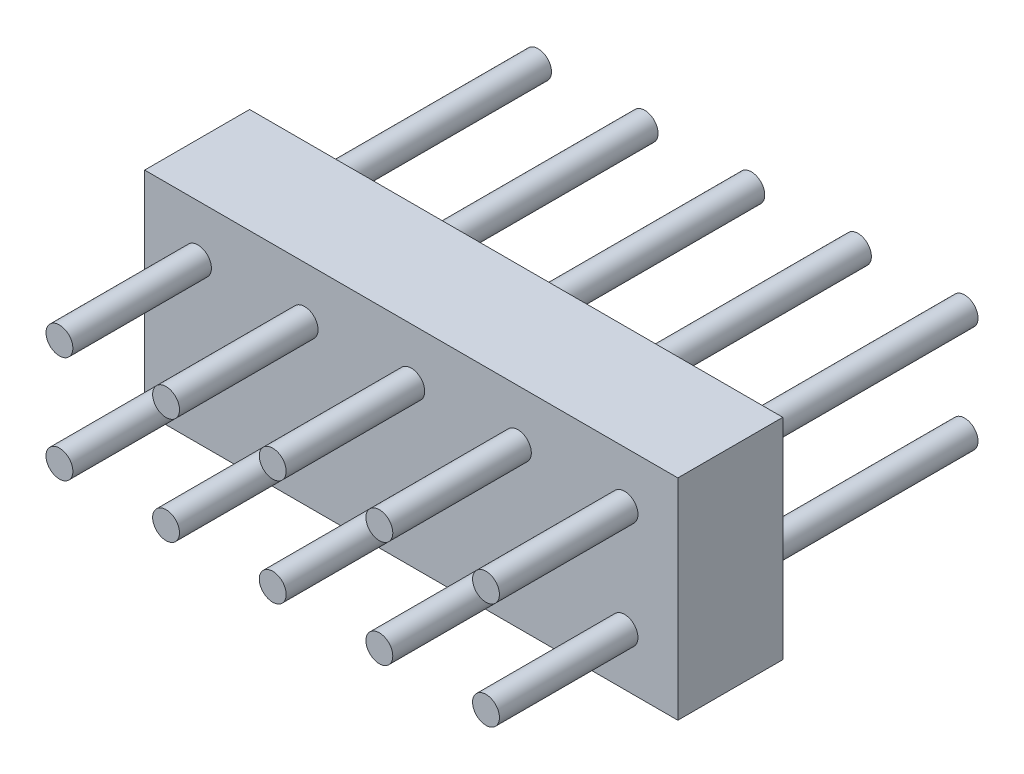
ISO-10303-21;
HEADER;
FILE_DESCRIPTION(('STEP AP214'),'2;1');
FILE_NAME('part.step','',(''),(''),'','','');
FILE_SCHEMA(('AUTOMOTIVE_DESIGN { 1 0 10303 214 1 1 1 1 }'));
ENDSEC;
DATA;
#1=APPLICATION_CONTEXT('core data for automotive mechanical design processes');
#2=APPLICATION_PROTOCOL_DEFINITION('international standard','automotive_design',2000,#1);
#3=PRODUCT_CONTEXT('',#1,'mechanical');
#4=PRODUCT('Part','Part','',(#3));
#5=PRODUCT_RELATED_PRODUCT_CATEGORY('part','',(#4));
#6=PRODUCT_DEFINITION_FORMATION('','',#4);
#7=PRODUCT_DEFINITION_CONTEXT('part definition',#1,'design');
#8=PRODUCT_DEFINITION('design','',#6,#7);
#9=PRODUCT_DEFINITION_SHAPE('','',#8);
#10=(LENGTH_UNIT() NAMED_UNIT(*) SI_UNIT(.MILLI.,.METRE.));
#11=(NAMED_UNIT(*) PLANE_ANGLE_UNIT() SI_UNIT($,.RADIAN.));
#12=(NAMED_UNIT(*) SI_UNIT($,.STERADIAN.) SOLID_ANGLE_UNIT());
#13=UNCERTAINTY_MEASURE_WITH_UNIT(LENGTH_MEASURE(1.E-05),#10,'distance_accuracy_value','');
#14=(GEOMETRIC_REPRESENTATION_CONTEXT(3) GLOBAL_UNCERTAINTY_ASSIGNED_CONTEXT((#13)) GLOBAL_UNIT_ASSIGNED_CONTEXT((#10,
#11,#12)) REPRESENTATION_CONTEXT('',''));
#15=CARTESIAN_POINT('',(0.,0.,0.));
#16=DIRECTION('',(0.,0.,1.));
#17=DIRECTION('',(1.,0.,0.));
#18=AXIS2_PLACEMENT_3D('',#15,#16,#17);
#19=CARTESIAN_POINT('',(0.,0.,2.5));
#20=DIRECTION('',(-1.,0.,0.));
#21=DIRECTION('',(0.,0.,1.));
#22=AXIS2_PLACEMENT_3D('',#19,#20,#21);
#23=PLANE('',#22);
#24=DIRECTION('',(0.,1.,0.));
#25=VECTOR('',#24,1.);
#26=CARTESIAN_POINT('',(0.,0.,0.));
#27=LINE('',#26,#25);
#28=CARTESIAN_POINT('',(0.,0.,0.));
#29=VERTEX_POINT('',#28);
#30=CARTESIAN_POINT('',(0.,5.,0.));
#31=VERTEX_POINT('',#30);
#32=EDGE_CURVE('E104',#29,#31,#27,.T.);
#33=ORIENTED_EDGE('',*,*,#32,.F.);
#34=DIRECTION('',(0.,0.,-1.));
#35=VECTOR('',#34,1.);
#36=CARTESIAN_POINT('',(0.,0.,2.5));
#37=LINE('',#36,#35);
#38=CARTESIAN_POINT('',(0.,0.,2.5));
#39=VERTEX_POINT('',#38);
#40=EDGE_CURVE('E51',#39,#29,#37,.T.);
#41=ORIENTED_EDGE('',*,*,#40,.F.);
#42=DIRECTION('',(0.,1.,0.));
#43=VECTOR('',#42,1.);
#44=CARTESIAN_POINT('',(0.,0.,2.5));
#45=LINE('',#44,#43);
#46=CARTESIAN_POINT('',(0.,5.,2.5));
#47=VERTEX_POINT('',#46);
#48=EDGE_CURVE('E98',#39,#47,#45,.T.);
#49=ORIENTED_EDGE('',*,*,#48,.T.);
#50=DIRECTION('',(0.,0.,-1.));
#51=VECTOR('',#50,1.);
#52=CARTESIAN_POINT('',(0.,5.,2.5));
#53=LINE('',#52,#51);
#54=EDGE_CURVE('E76',#47,#31,#53,.T.);
#55=ORIENTED_EDGE('',*,*,#54,.T.);
#56=EDGE_LOOP('',(#33,#41,#49,#55));
#57=FACE_BOUND('',#56,.T.);
#58=ADVANCED_FACE('F35',(#57),#23,.T.);
#59=CARTESIAN_POINT('',(0.,0.,2.5));
#60=DIRECTION('',(0.,1.,0.));
#61=DIRECTION('',(0.,0.,1.));
#62=AXIS2_PLACEMENT_3D('',#59,#60,#61);
#63=PLANE('',#62);
#64=DIRECTION('',(1.,0.,0.));
#65=VECTOR('',#64,1.);
#66=CARTESIAN_POINT('',(0.,0.,0.));
#67=LINE('',#66,#65);
#68=CARTESIAN_POINT('',(12.7,0.,0.));
#69=VERTEX_POINT('',#68);
#70=EDGE_CURVE('E68',#29,#69,#67,.T.);
#71=ORIENTED_EDGE('',*,*,#70,.T.);
#72=DIRECTION('',(0.,0.,-1.));
#73=VECTOR('',#72,1.);
#74=CARTESIAN_POINT('',(12.7,0.,2.5));
#75=LINE('',#74,#73);
#76=CARTESIAN_POINT('',(12.7,0.,2.5));
#77=VERTEX_POINT('',#76);
#78=EDGE_CURVE('E95',#77,#69,#75,.T.);
#79=ORIENTED_EDGE('',*,*,#78,.F.);
#80=DIRECTION('',(1.,0.,0.));
#81=VECTOR('',#80,1.);
#82=CARTESIAN_POINT('',(0.,0.,2.5));
#83=LINE('',#82,#81);
#84=EDGE_CURVE('E86',#39,#77,#83,.T.);
#85=ORIENTED_EDGE('',*,*,#84,.F.);
#86=ORIENTED_EDGE('',*,*,#40,.T.);
#87=EDGE_LOOP('',(#71,#79,#85,#86));
#88=FACE_BOUND('',#87,.T.);
#89=ADVANCED_FACE('F278',(#88),#63,.F.);
#90=CARTESIAN_POINT('',(12.7,0.,2.5));
#91=DIRECTION('',(-1.,0.,0.));
#92=DIRECTION('',(0.,0.,1.));
#93=AXIS2_PLACEMENT_3D('',#90,#91,#92);
#94=PLANE('',#93);
#95=DIRECTION('',(0.,1.,0.));
#96=VECTOR('',#95,1.);
#97=CARTESIAN_POINT('',(12.7,0.,0.));
#98=LINE('',#97,#96);
#99=CARTESIAN_POINT('',(12.7,5.,0.));
#100=VERTEX_POINT('',#99);
#101=EDGE_CURVE('E93',#69,#100,#98,.T.);
#102=ORIENTED_EDGE('',*,*,#101,.T.);
#103=DIRECTION('',(0.,0.,-1.));
#104=VECTOR('',#103,1.);
#105=CARTESIAN_POINT('',(12.7,5.,2.5));
#106=LINE('',#105,#104);
#107=CARTESIAN_POINT('',(12.7,5.,2.5));
#108=VERTEX_POINT('',#107);
#109=EDGE_CURVE('E90',#108,#100,#106,.T.);
#110=ORIENTED_EDGE('',*,*,#109,.F.);
#111=DIRECTION('',(0.,1.,0.));
#112=VECTOR('',#111,1.);
#113=CARTESIAN_POINT('',(12.7,0.,2.5));
#114=LINE('',#113,#112);
#115=EDGE_CURVE('E81',#77,#108,#114,.T.);
#116=ORIENTED_EDGE('',*,*,#115,.F.);
#117=ORIENTED_EDGE('',*,*,#78,.T.);
#118=EDGE_LOOP('',(#102,#110,#116,#117));
#119=FACE_BOUND('',#118,.T.);
#120=ADVANCED_FACE('F91',(#119),#94,.F.);
#121=CARTESIAN_POINT('',(0.,5.,2.5));
#122=DIRECTION('',(0.,1.,0.));
#123=DIRECTION('',(0.,0.,1.));
#124=AXIS2_PLACEMENT_3D('',#121,#122,#123);
#125=PLANE('',#124);
#126=DIRECTION('',(1.,0.,0.));
#127=VECTOR('',#126,1.);
#128=CARTESIAN_POINT('',(0.,5.,0.));
#129=LINE('',#128,#127);
#130=EDGE_CURVE('E107',#31,#100,#129,.T.);
#131=ORIENTED_EDGE('',*,*,#130,.F.);
#132=ORIENTED_EDGE('',*,*,#54,.F.);
#133=DIRECTION('',(1.,0.,0.));
#134=VECTOR('',#133,1.);
#135=CARTESIAN_POINT('',(0.,5.,2.5));
#136=LINE('',#135,#134);
#137=EDGE_CURVE('E85',#47,#108,#136,.T.);
#138=ORIENTED_EDGE('',*,*,#137,.T.);
#139=ORIENTED_EDGE('',*,*,#109,.T.);
#140=EDGE_LOOP('',(#131,#132,#138,#139));
#141=FACE_BOUND('',#140,.T.);
#142=ADVANCED_FACE('F97',(#141),#125,.T.);
#143=CARTESIAN_POINT('',(0.,0.,2.5));
#144=DIRECTION('',(0.,0.,-1.));
#145=DIRECTION('',(-1.,0.,0.));
#146=AXIS2_PLACEMENT_3D('',#143,#144,#145);
#147=PLANE('',#146);
#148=CARTESIAN_POINT('',(1.27,3.77,2.5));
#149=DIRECTION('',(0.,0.,-1.));
#150=DIRECTION('',(-1.,0.,0.));
#151=AXIS2_PLACEMENT_3D('',#148,#149,#150);
#152=CIRCLE('',#151,0.32);
#153=CARTESIAN_POINT('',(0.949999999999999,3.77,2.5));
#154=VERTEX_POINT('',#153);
#155=EDGE_CURVE('E177',#154,#154,#152,.T.);
#156=ORIENTED_EDGE('',*,*,#155,.T.);
#157=EDGE_LOOP('',(#156));
#158=FACE_BOUND('',#157,.T.);
#159=CARTESIAN_POINT('',(3.81,3.77,2.5));
#160=DIRECTION('',(0.,0.,-1.));
#161=DIRECTION('',(-1.,0.,0.));
#162=AXIS2_PLACEMENT_3D('',#159,#160,#161);
#163=CIRCLE('',#162,0.319999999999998);
#164=CARTESIAN_POINT('',(3.49,3.77,2.5));
#165=VERTEX_POINT('',#164);
#166=EDGE_CURVE('E171',#165,#165,#163,.T.);
#167=ORIENTED_EDGE('',*,*,#166,.T.);
#168=EDGE_LOOP('',(#167));
#169=FACE_BOUND('',#168,.T.);
#170=CARTESIAN_POINT('',(6.35,3.77,2.5));
#171=DIRECTION('',(0.,0.,-1.));
#172=DIRECTION('',(-1.,0.,0.));
#173=AXIS2_PLACEMENT_3D('',#170,#171,#172);
#174=CIRCLE('',#173,0.32);
#175=CARTESIAN_POINT('',(6.03,3.77,2.5));
#176=VERTEX_POINT('',#175);
#177=EDGE_CURVE('E165',#176,#176,#174,.T.);
#178=ORIENTED_EDGE('',*,*,#177,.T.);
#179=EDGE_LOOP('',(#178));
#180=FACE_BOUND('',#179,.T.);
#181=CARTESIAN_POINT('',(8.88999999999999,3.77,2.5));
#182=DIRECTION('',(0.,0.,-1.));
#183=DIRECTION('',(-1.,0.,0.));
#184=AXIS2_PLACEMENT_3D('',#181,#182,#183);
#185=CIRCLE('',#184,0.319999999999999);
#186=CARTESIAN_POINT('',(8.56999999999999,3.77,2.5));
#187=VERTEX_POINT('',#186);
#188=EDGE_CURVE('E161',#187,#187,#185,.T.);
#189=ORIENTED_EDGE('',*,*,#188,.T.);
#190=EDGE_LOOP('',(#189));
#191=FACE_BOUND('',#190,.T.);
#192=CARTESIAN_POINT('',(8.89,1.23,2.5));
#193=DIRECTION('',(0.,0.,-1.));
#194=DIRECTION('',(-1.,0.,0.));
#195=AXIS2_PLACEMENT_3D('',#192,#193,#194);
#196=CIRCLE('',#195,0.319999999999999);
#197=CARTESIAN_POINT('',(8.57,1.23,2.5));
#198=VERTEX_POINT('',#197);
#199=EDGE_CURVE('E11',#198,#198,#196,.F.);
#200=ORIENTED_EDGE('',*,*,#199,.F.);
#201=EDGE_LOOP('',(#200));
#202=FACE_BOUND('',#201,.T.);
#203=CARTESIAN_POINT('',(11.43,1.23,2.5));
#204=DIRECTION('',(0.,0.,-1.));
#205=DIRECTION('',(-1.,0.,0.));
#206=AXIS2_PLACEMENT_3D('',#203,#204,#205);
#207=CIRCLE('',#206,0.319999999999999);
#208=CARTESIAN_POINT('',(11.11,1.23,2.5));
#209=VERTEX_POINT('',#208);
#210=EDGE_CURVE('E43',#209,#209,#207,.F.);
#211=ORIENTED_EDGE('',*,*,#210,.F.);
#212=EDGE_LOOP('',(#211));
#213=FACE_BOUND('',#212,.T.);
#214=CARTESIAN_POINT('',(1.27,1.23,2.5));
#215=DIRECTION('',(0.,0.,-1.));
#216=DIRECTION('',(-1.,0.,0.));
#217=AXIS2_PLACEMENT_3D('',#214,#215,#216);
#218=CIRCLE('',#217,0.32);
#219=CARTESIAN_POINT('',(0.95,1.23,2.5));
#220=VERTEX_POINT('',#219);
#221=EDGE_CURVE('E121',#220,#220,#218,.F.);
#222=ORIENTED_EDGE('',*,*,#221,.F.);
#223=EDGE_LOOP('',(#222));
#224=FACE_BOUND('',#223,.T.);
#225=CARTESIAN_POINT('',(3.81,1.23,2.5));
#226=DIRECTION('',(0.,0.,-1.));
#227=DIRECTION('',(-1.,0.,0.));
#228=AXIS2_PLACEMENT_3D('',#225,#226,#227);
#229=CIRCLE('',#228,0.32);
#230=CARTESIAN_POINT('',(3.49,1.23,2.5));
#231=VERTEX_POINT('',#230);
#232=EDGE_CURVE('E118',#231,#231,#229,.F.);
#233=ORIENTED_EDGE('',*,*,#232,.F.);
#234=EDGE_LOOP('',(#233));
#235=FACE_BOUND('',#234,.T.);
#236=CARTESIAN_POINT('',(6.35,1.23,2.5));
#237=DIRECTION('',(0.,0.,-1.));
#238=DIRECTION('',(-1.,0.,0.));
#239=AXIS2_PLACEMENT_3D('',#236,#237,#238);
#240=CIRCLE('',#239,0.32);
#241=CARTESIAN_POINT('',(6.03,1.23,2.5));
#242=VERTEX_POINT('',#241);
#243=EDGE_CURVE('E113',#242,#242,#240,.F.);
#244=ORIENTED_EDGE('',*,*,#243,.F.);
#245=EDGE_LOOP('',(#244));
#246=FACE_BOUND('',#245,.T.);
#247=CARTESIAN_POINT('',(11.43,3.77,2.5));
#248=DIRECTION('',(0.,0.,-1.));
#249=DIRECTION('',(-1.,0.,0.));
#250=AXIS2_PLACEMENT_3D('',#247,#248,#249);
#251=CIRCLE('',#250,0.319999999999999);
#252=CARTESIAN_POINT('',(11.11,3.77,2.5));
#253=VERTEX_POINT('',#252);
#254=EDGE_CURVE('E141',#253,#253,#251,.T.);
#255=ORIENTED_EDGE('',*,*,#254,.T.);
#256=EDGE_LOOP('',(#255));
#257=FACE_BOUND('',#256,.T.);
#258=ORIENTED_EDGE('',*,*,#48,.F.);
#259=ORIENTED_EDGE('',*,*,#84,.T.);
#260=ORIENTED_EDGE('',*,*,#115,.T.);
#261=ORIENTED_EDGE('',*,*,#137,.F.);
#262=EDGE_LOOP('',(#258,#259,#260,#261));
#263=FACE_BOUND('',#262,.T.);
#264=ADVANCED_FACE('F84',(#158,#169,#180,#191,#202,#213,#224,#235,#246,#257,#263),#147,.F.);
#265=CARTESIAN_POINT('',(0.,0.,0.));
#266=DIRECTION('',(0.,0.,-1.));
#267=DIRECTION('',(-1.,0.,0.));
#268=AXIS2_PLACEMENT_3D('',#265,#266,#267);
#269=PLANE('',#268);
#270=CARTESIAN_POINT('',(1.27,3.77,0.));
#271=DIRECTION('',(0.,0.,-1.));
#272=DIRECTION('',(-1.,0.,0.));
#273=AXIS2_PLACEMENT_3D('',#270,#271,#272);
#274=CIRCLE('',#273,0.32);
#275=CARTESIAN_POINT('',(0.949999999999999,3.77,0.));
#276=VERTEX_POINT('',#275);
#277=EDGE_CURVE('E240',#276,#276,#274,.T.);
#278=ORIENTED_EDGE('',*,*,#277,.F.);
#279=EDGE_LOOP('',(#278));
#280=FACE_BOUND('',#279,.T.);
#281=CARTESIAN_POINT('',(3.81,3.77,0.));
#282=DIRECTION('',(0.,0.,-1.));
#283=DIRECTION('',(-1.,0.,0.));
#284=AXIS2_PLACEMENT_3D('',#281,#282,#283);
#285=CIRCLE('',#284,0.319999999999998);
#286=CARTESIAN_POINT('',(3.49,3.77,0.));
#287=VERTEX_POINT('',#286);
#288=EDGE_CURVE('E234',#287,#287,#285,.T.);
#289=ORIENTED_EDGE('',*,*,#288,.F.);
#290=EDGE_LOOP('',(#289));
#291=FACE_BOUND('',#290,.T.);
#292=CARTESIAN_POINT('',(6.35,3.77,0.));
#293=DIRECTION('',(0.,0.,-1.));
#294=DIRECTION('',(-1.,0.,0.));
#295=AXIS2_PLACEMENT_3D('',#292,#293,#294);
#296=CIRCLE('',#295,0.32);
#297=CARTESIAN_POINT('',(6.03,3.77,0.));
#298=VERTEX_POINT('',#297);
#299=EDGE_CURVE('E228',#298,#298,#296,.T.);
#300=ORIENTED_EDGE('',*,*,#299,.F.);
#301=EDGE_LOOP('',(#300));
#302=FACE_BOUND('',#301,.T.);
#303=CARTESIAN_POINT('',(8.88999999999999,3.77,0.));
#304=DIRECTION('',(0.,0.,-1.));
#305=DIRECTION('',(-1.,0.,0.));
#306=AXIS2_PLACEMENT_3D('',#303,#304,#305);
#307=CIRCLE('',#306,0.319999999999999);
#308=CARTESIAN_POINT('',(8.56999999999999,3.77,0.));
#309=VERTEX_POINT('',#308);
#310=EDGE_CURVE('E222',#309,#309,#307,.T.);
#311=ORIENTED_EDGE('',*,*,#310,.F.);
#312=EDGE_LOOP('',(#311));
#313=FACE_BOUND('',#312,.T.);
#314=CARTESIAN_POINT('',(11.43,1.23,0.));
#315=DIRECTION('',(0.,0.,-1.));
#316=DIRECTION('',(-1.,0.,0.));
#317=AXIS2_PLACEMENT_3D('',#314,#315,#316);
#318=CIRCLE('',#317,0.319999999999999);
#319=CARTESIAN_POINT('',(11.11,1.23,0.));
#320=VERTEX_POINT('',#319);
#321=EDGE_CURVE('E216',#320,#320,#318,.T.);
#322=ORIENTED_EDGE('',*,*,#321,.F.);
#323=EDGE_LOOP('',(#322));
#324=FACE_BOUND('',#323,.T.);
#325=CARTESIAN_POINT('',(8.89,1.23,0.));
#326=DIRECTION('',(0.,0.,-1.));
#327=DIRECTION('',(-1.,0.,0.));
#328=AXIS2_PLACEMENT_3D('',#325,#326,#327);
#329=CIRCLE('',#328,0.319999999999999);
#330=CARTESIAN_POINT('',(8.57,1.23,0.));
#331=VERTEX_POINT('',#330);
#332=EDGE_CURVE('E210',#331,#331,#329,.T.);
#333=ORIENTED_EDGE('',*,*,#332,.F.);
#334=EDGE_LOOP('',(#333));
#335=FACE_BOUND('',#334,.T.);
#336=CARTESIAN_POINT('',(6.35,1.23,0.));
#337=DIRECTION('',(0.,0.,-1.));
#338=DIRECTION('',(-1.,0.,0.));
#339=AXIS2_PLACEMENT_3D('',#336,#337,#338);
#340=CIRCLE('',#339,0.32);
#341=CARTESIAN_POINT('',(6.03,1.23,0.));
#342=VERTEX_POINT('',#341);
#343=EDGE_CURVE('E204',#342,#342,#340,.T.);
#344=ORIENTED_EDGE('',*,*,#343,.F.);
#345=EDGE_LOOP('',(#344));
#346=FACE_BOUND('',#345,.T.);
#347=CARTESIAN_POINT('',(3.81,1.23,0.));
#348=DIRECTION('',(0.,0.,-1.));
#349=DIRECTION('',(-1.,0.,0.));
#350=AXIS2_PLACEMENT_3D('',#347,#348,#349);
#351=CIRCLE('',#350,0.32);
#352=CARTESIAN_POINT('',(3.49,1.23,0.));
#353=VERTEX_POINT('',#352);
#354=EDGE_CURVE('E198',#353,#353,#351,.T.);
#355=ORIENTED_EDGE('',*,*,#354,.F.);
#356=EDGE_LOOP('',(#355));
#357=FACE_BOUND('',#356,.T.);
#358=CARTESIAN_POINT('',(11.43,3.77,0.));
#359=DIRECTION('',(0.,0.,-1.));
#360=DIRECTION('',(-1.,0.,0.));
#361=AXIS2_PLACEMENT_3D('',#358,#359,#360);
#362=CIRCLE('',#361,0.319999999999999);
#363=CARTESIAN_POINT('',(11.11,3.77,0.));
#364=VERTEX_POINT('',#363);
#365=EDGE_CURVE('E192',#364,#364,#362,.T.);
#366=ORIENTED_EDGE('',*,*,#365,.F.);
#367=EDGE_LOOP('',(#366));
#368=FACE_BOUND('',#367,.T.);
#369=CARTESIAN_POINT('',(1.27,1.23,0.));
#370=DIRECTION('',(0.,0.,-1.));
#371=DIRECTION('',(-1.,0.,0.));
#372=AXIS2_PLACEMENT_3D('',#369,#370,#371);
#373=CIRCLE('',#372,0.32);
#374=CARTESIAN_POINT('',(0.95,1.23,0.));
#375=VERTEX_POINT('',#374);
#376=EDGE_CURVE('E186',#375,#375,#373,.T.);
#377=ORIENTED_EDGE('',*,*,#376,.F.);
#378=EDGE_LOOP('',(#377));
#379=FACE_BOUND('',#378,.T.);
#380=ORIENTED_EDGE('',*,*,#32,.T.);
#381=ORIENTED_EDGE('',*,*,#130,.T.);
#382=ORIENTED_EDGE('',*,*,#101,.F.);
#383=ORIENTED_EDGE('',*,*,#70,.F.);
#384=EDGE_LOOP('',(#380,#381,#382,#383));
#385=FACE_BOUND('',#384,.T.);
#386=ADVANCED_FACE('F130',(#280,#291,#302,#313,#324,#335,#346,#357,#368,#379,#385),#269,.T.);
#387=CARTESIAN_POINT('',(11.43,3.77,5.8));
#388=DIRECTION('',(0.,0.,-1.));
#389=DIRECTION('',(-1.,0.,0.));
#390=AXIS2_PLACEMENT_3D('',#387,#388,#389);
#391=CYLINDRICAL_SURFACE('',#390,0.319999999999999);
#392=CARTESIAN_POINT('',(11.43,3.77,5.8));
#393=DIRECTION('',(0.,0.,-1.));
#394=DIRECTION('',(-1.,0.,0.));
#395=AXIS2_PLACEMENT_3D('',#392,#393,#394);
#396=CIRCLE('',#395,0.319999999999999);
#397=CARTESIAN_POINT('',(11.11,3.77,5.8));
#398=VERTEX_POINT('',#397);
#399=EDGE_CURVE('E108',#398,#398,#396,.T.);
#400=ORIENTED_EDGE('',*,*,#399,.T.);
#401=EDGE_LOOP('',(#400));
#402=FACE_BOUND('',#401,.T.);
#403=ORIENTED_EDGE('',*,*,#254,.F.);
#404=EDGE_LOOP('',(#403));
#405=FACE_BOUND('',#404,.T.);
#406=ADVANCED_FACE('F257',(#402,#405),#391,.T.);
#407=CARTESIAN_POINT('',(11.43,3.77,5.8));
#408=DIRECTION('',(0.,0.,-1.));
#409=DIRECTION('',(-1.,0.,0.));
#410=AXIS2_PLACEMENT_3D('',#407,#408,#409);
#411=PLANE('',#410);
#412=ORIENTED_EDGE('',*,*,#399,.F.);
#413=EDGE_LOOP('',(#412));
#414=FACE_BOUND('',#413,.T.);
#415=ADVANCED_FACE('F308',(#414),#411,.F.);
#416=CARTESIAN_POINT('',(6.35,1.23,5.8));
#417=DIRECTION('',(0.,0.,-1.));
#418=DIRECTION('',(-1.,0.,0.));
#419=AXIS2_PLACEMENT_3D('',#416,#417,#418);
#420=CYLINDRICAL_SURFACE('',#419,0.32);
#421=CARTESIAN_POINT('',(6.35,1.23,5.8));
#422=DIRECTION('',(0.,0.,1.));
#423=DIRECTION('',(1.,0.,0.));
#424=AXIS2_PLACEMENT_3D('',#421,#422,#423);
#425=CIRCLE('',#424,0.32);
#426=CARTESIAN_POINT('',(6.67,1.23,5.8));
#427=VERTEX_POINT('',#426);
#428=EDGE_CURVE('E143',#427,#427,#425,.T.);
#429=ORIENTED_EDGE('',*,*,#428,.F.);
#430=EDGE_LOOP('',(#429));
#431=FACE_BOUND('',#430,.T.);
#432=ORIENTED_EDGE('',*,*,#243,.T.);
#433=EDGE_LOOP('',(#432));
#434=FACE_BOUND('',#433,.T.);
#435=ADVANCED_FACE('F316',(#431,#434),#420,.T.);
#436=CARTESIAN_POINT('',(6.35,1.23,5.8));
#437=DIRECTION('',(0.,0.,1.));
#438=DIRECTION('',(1.,0.,0.));
#439=AXIS2_PLACEMENT_3D('',#436,#437,#438);
#440=PLANE('',#439);
#441=ORIENTED_EDGE('',*,*,#428,.T.);
#442=EDGE_LOOP('',(#441));
#443=FACE_BOUND('',#442,.T.);
#444=ADVANCED_FACE('F324',(#443),#440,.T.);
#445=CARTESIAN_POINT('',(3.81,1.23,5.8));
#446=DIRECTION('',(0.,0.,-1.));
#447=DIRECTION('',(-1.,0.,0.));
#448=AXIS2_PLACEMENT_3D('',#445,#446,#447);
#449=CYLINDRICAL_SURFACE('',#448,0.32);
#450=CARTESIAN_POINT('',(3.81,1.23,5.8));
#451=DIRECTION('',(0.,0.,1.));
#452=DIRECTION('',(1.,0.,0.));
#453=AXIS2_PLACEMENT_3D('',#450,#451,#452);
#454=CIRCLE('',#453,0.32);
#455=CARTESIAN_POINT('',(4.13,1.23,5.8));
#456=VERTEX_POINT('',#455);
#457=EDGE_CURVE('E147',#456,#456,#454,.T.);
#458=ORIENTED_EDGE('',*,*,#457,.F.);
#459=EDGE_LOOP('',(#458));
#460=FACE_BOUND('',#459,.T.);
#461=ORIENTED_EDGE('',*,*,#232,.T.);
#462=EDGE_LOOP('',(#461));
#463=FACE_BOUND('',#462,.T.);
#464=ADVANCED_FACE('F332',(#460,#463),#449,.T.);
#465=CARTESIAN_POINT('',(3.81,1.23,5.8));
#466=DIRECTION('',(0.,0.,1.));
#467=DIRECTION('',(1.,0.,0.));
#468=AXIS2_PLACEMENT_3D('',#465,#466,#467);
#469=PLANE('',#468);
#470=ORIENTED_EDGE('',*,*,#457,.T.);
#471=EDGE_LOOP('',(#470));
#472=FACE_BOUND('',#471,.T.);
#473=ADVANCED_FACE('F340',(#472),#469,.T.);
#474=CARTESIAN_POINT('',(1.27,1.23,5.8));
#475=DIRECTION('',(0.,0.,-1.));
#476=DIRECTION('',(-1.,0.,0.));
#477=AXIS2_PLACEMENT_3D('',#474,#475,#476);
#478=CYLINDRICAL_SURFACE('',#477,0.32);
#479=CARTESIAN_POINT('',(1.27,1.23,5.8));
#480=DIRECTION('',(0.,0.,1.));
#481=DIRECTION('',(1.,0.,0.));
#482=AXIS2_PLACEMENT_3D('',#479,#480,#481);
#483=CIRCLE('',#482,0.32);
#484=CARTESIAN_POINT('',(1.59,1.23,5.8));
#485=VERTEX_POINT('',#484);
#486=EDGE_CURVE('E152',#485,#485,#483,.T.);
#487=ORIENTED_EDGE('',*,*,#486,.F.);
#488=EDGE_LOOP('',(#487));
#489=FACE_BOUND('',#488,.T.);
#490=ORIENTED_EDGE('',*,*,#221,.T.);
#491=EDGE_LOOP('',(#490));
#492=FACE_BOUND('',#491,.T.);
#493=ADVANCED_FACE('F348',(#489,#492),#478,.T.);
#494=CARTESIAN_POINT('',(1.27,1.23,5.8));
#495=DIRECTION('',(0.,0.,1.));
#496=DIRECTION('',(1.,0.,0.));
#497=AXIS2_PLACEMENT_3D('',#494,#495,#496);
#498=PLANE('',#497);
#499=ORIENTED_EDGE('',*,*,#486,.T.);
#500=EDGE_LOOP('',(#499));
#501=FACE_BOUND('',#500,.T.);
#502=ADVANCED_FACE('F356',(#501),#498,.T.);
#503=CARTESIAN_POINT('',(11.43,1.23,5.8));
#504=DIRECTION('',(0.,0.,-1.));
#505=DIRECTION('',(-1.,0.,0.));
#506=AXIS2_PLACEMENT_3D('',#503,#504,#505);
#507=CYLINDRICAL_SURFACE('',#506,0.319999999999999);
#508=CARTESIAN_POINT('',(11.43,1.23,5.8));
#509=DIRECTION('',(0.,0.,1.));
#510=DIRECTION('',(1.,0.,0.));
#511=AXIS2_PLACEMENT_3D('',#508,#509,#510);
#512=CIRCLE('',#511,0.319999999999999);
#513=CARTESIAN_POINT('',(11.75,1.23,5.8));
#514=VERTEX_POINT('',#513);
#515=EDGE_CURVE('E155',#514,#514,#512,.T.);
#516=ORIENTED_EDGE('',*,*,#515,.F.);
#517=EDGE_LOOP('',(#516));
#518=FACE_BOUND('',#517,.T.);
#519=ORIENTED_EDGE('',*,*,#210,.T.);
#520=EDGE_LOOP('',(#519));
#521=FACE_BOUND('',#520,.T.);
#522=ADVANCED_FACE('F126',(#518,#521),#507,.T.);
#523=CARTESIAN_POINT('',(11.43,1.23,5.8));
#524=DIRECTION('',(0.,0.,1.));
#525=DIRECTION('',(1.,0.,0.));
#526=AXIS2_PLACEMENT_3D('',#523,#524,#525);
#527=PLANE('',#526);
#528=ORIENTED_EDGE('',*,*,#515,.T.);
#529=EDGE_LOOP('',(#528));
#530=FACE_BOUND('',#529,.T.);
#531=ADVANCED_FACE('F371',(#530),#527,.T.);
#532=CARTESIAN_POINT('',(8.89,1.23,5.8));
#533=DIRECTION('',(0.,0.,-1.));
#534=DIRECTION('',(-1.,0.,0.));
#535=AXIS2_PLACEMENT_3D('',#532,#533,#534);
#536=CYLINDRICAL_SURFACE('',#535,0.319999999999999);
#537=CARTESIAN_POINT('',(8.89,1.23,5.8));
#538=DIRECTION('',(0.,0.,1.));
#539=DIRECTION('',(1.,0.,0.));
#540=AXIS2_PLACEMENT_3D('',#537,#538,#539);
#541=CIRCLE('',#540,0.319999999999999);
#542=CARTESIAN_POINT('',(9.21,1.23,5.8));
#543=VERTEX_POINT('',#542);
#544=EDGE_CURVE('E158',#543,#543,#541,.T.);
#545=ORIENTED_EDGE('',*,*,#544,.F.);
#546=EDGE_LOOP('',(#545));
#547=FACE_BOUND('',#546,.T.);
#548=ORIENTED_EDGE('',*,*,#199,.T.);
#549=EDGE_LOOP('',(#548));
#550=FACE_BOUND('',#549,.T.);
#551=ADVANCED_FACE('F379',(#547,#550),#536,.T.);
#552=CARTESIAN_POINT('',(8.89,1.23,5.8));
#553=DIRECTION('',(0.,0.,1.));
#554=DIRECTION('',(1.,0.,0.));
#555=AXIS2_PLACEMENT_3D('',#552,#553,#554);
#556=PLANE('',#555);
#557=ORIENTED_EDGE('',*,*,#544,.T.);
#558=EDGE_LOOP('',(#557));
#559=FACE_BOUND('',#558,.T.);
#560=ADVANCED_FACE('F387',(#559),#556,.T.);
#561=CARTESIAN_POINT('',(8.88999999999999,3.77,5.8));
#562=DIRECTION('',(0.,0.,-1.));
#563=DIRECTION('',(-1.,0.,0.));
#564=AXIS2_PLACEMENT_3D('',#561,#562,#563);
#565=CYLINDRICAL_SURFACE('',#564,0.319999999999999);
#566=CARTESIAN_POINT('',(8.88999999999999,3.77,5.8));
#567=DIRECTION('',(0.,0.,-1.));
#568=DIRECTION('',(-1.,0.,0.));
#569=AXIS2_PLACEMENT_3D('',#566,#567,#568);
#570=CIRCLE('',#569,0.319999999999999);
#571=CARTESIAN_POINT('',(8.56999999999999,3.77,5.8));
#572=VERTEX_POINT('',#571);
#573=EDGE_CURVE('E162',#572,#572,#570,.T.);
#574=ORIENTED_EDGE('',*,*,#573,.T.);
#575=EDGE_LOOP('',(#574));
#576=FACE_BOUND('',#575,.T.);
#577=ORIENTED_EDGE('',*,*,#188,.F.);
#578=EDGE_LOOP('',(#577));
#579=FACE_BOUND('',#578,.T.);
#580=ADVANCED_FACE('F395',(#576,#579),#565,.T.);
#581=CARTESIAN_POINT('',(8.88999999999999,3.77,5.8));
#582=DIRECTION('',(0.,0.,-1.));
#583=DIRECTION('',(-1.,0.,0.));
#584=AXIS2_PLACEMENT_3D('',#581,#582,#583);
#585=PLANE('',#584);
#586=ORIENTED_EDGE('',*,*,#573,.F.);
#587=EDGE_LOOP('',(#586));
#588=FACE_BOUND('',#587,.T.);
#589=ADVANCED_FACE('F403',(#588),#585,.F.);
#590=CARTESIAN_POINT('',(6.35,3.77,5.8));
#591=DIRECTION('',(0.,0.,-1.));
#592=DIRECTION('',(-1.,0.,0.));
#593=AXIS2_PLACEMENT_3D('',#590,#591,#592);
#594=CYLINDRICAL_SURFACE('',#593,0.32);
#595=CARTESIAN_POINT('',(6.35,3.77,5.8));
#596=DIRECTION('',(0.,0.,-1.));
#597=DIRECTION('',(-1.,0.,0.));
#598=AXIS2_PLACEMENT_3D('',#595,#596,#597);
#599=CIRCLE('',#598,0.32);
#600=CARTESIAN_POINT('',(6.03,3.77,5.8));
#601=VERTEX_POINT('',#600);
#602=EDGE_CURVE('E168',#601,#601,#599,.T.);
#603=ORIENTED_EDGE('',*,*,#602,.T.);
#604=EDGE_LOOP('',(#603));
#605=FACE_BOUND('',#604,.T.);
#606=ORIENTED_EDGE('',*,*,#177,.F.);
#607=EDGE_LOOP('',(#606));
#608=FACE_BOUND('',#607,.T.);
#609=ADVANCED_FACE('F411',(#605,#608),#594,.T.);
#610=CARTESIAN_POINT('',(6.35,3.77,5.8));
#611=DIRECTION('',(0.,0.,-1.));
#612=DIRECTION('',(-1.,0.,0.));
#613=AXIS2_PLACEMENT_3D('',#610,#611,#612);
#614=PLANE('',#613);
#615=ORIENTED_EDGE('',*,*,#602,.F.);
#616=EDGE_LOOP('',(#615));
#617=FACE_BOUND('',#616,.T.);
#618=ADVANCED_FACE('F419',(#617),#614,.F.);
#619=CARTESIAN_POINT('',(3.81,3.77,5.8));
#620=DIRECTION('',(0.,0.,-1.));
#621=DIRECTION('',(-1.,0.,0.));
#622=AXIS2_PLACEMENT_3D('',#619,#620,#621);
#623=CYLINDRICAL_SURFACE('',#622,0.319999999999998);
#624=CARTESIAN_POINT('',(3.81,3.77,5.8));
#625=DIRECTION('',(0.,0.,-1.));
#626=DIRECTION('',(-1.,0.,0.));
#627=AXIS2_PLACEMENT_3D('',#624,#625,#626);
#628=CIRCLE('',#627,0.319999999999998);
#629=CARTESIAN_POINT('',(3.49,3.77,5.8));
#630=VERTEX_POINT('',#629);
#631=EDGE_CURVE('E174',#630,#630,#628,.T.);
#632=ORIENTED_EDGE('',*,*,#631,.T.);
#633=EDGE_LOOP('',(#632));
#634=FACE_BOUND('',#633,.T.);
#635=ORIENTED_EDGE('',*,*,#166,.F.);
#636=EDGE_LOOP('',(#635));
#637=FACE_BOUND('',#636,.T.);
#638=ADVANCED_FACE('F427',(#634,#637),#623,.T.);
#639=CARTESIAN_POINT('',(3.81,3.77,5.8));
#640=DIRECTION('',(0.,0.,-1.));
#641=DIRECTION('',(-1.,0.,0.));
#642=AXIS2_PLACEMENT_3D('',#639,#640,#641);
#643=PLANE('',#642);
#644=ORIENTED_EDGE('',*,*,#631,.F.);
#645=EDGE_LOOP('',(#644));
#646=FACE_BOUND('',#645,.T.);
#647=ADVANCED_FACE('F435',(#646),#643,.F.);
#648=CARTESIAN_POINT('',(1.27,3.77,5.8));
#649=DIRECTION('',(0.,0.,-1.));
#650=DIRECTION('',(-1.,0.,0.));
#651=AXIS2_PLACEMENT_3D('',#648,#649,#650);
#652=CYLINDRICAL_SURFACE('',#651,0.32);
#653=CARTESIAN_POINT('',(1.27,3.77,5.8));
#654=DIRECTION('',(0.,0.,-1.));
#655=DIRECTION('',(-1.,0.,0.));
#656=AXIS2_PLACEMENT_3D('',#653,#654,#655);
#657=CIRCLE('',#656,0.32);
#658=CARTESIAN_POINT('',(0.949999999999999,3.77,5.8));
#659=VERTEX_POINT('',#658);
#660=EDGE_CURVE('E180',#659,#659,#657,.T.);
#661=ORIENTED_EDGE('',*,*,#660,.T.);
#662=EDGE_LOOP('',(#661));
#663=FACE_BOUND('',#662,.T.);
#664=ORIENTED_EDGE('',*,*,#155,.F.);
#665=EDGE_LOOP('',(#664));
#666=FACE_BOUND('',#665,.T.);
#667=ADVANCED_FACE('F443',(#663,#666),#652,.T.);
#668=CARTESIAN_POINT('',(1.27,3.77,5.8));
#669=DIRECTION('',(0.,0.,-1.));
#670=DIRECTION('',(-1.,0.,0.));
#671=AXIS2_PLACEMENT_3D('',#668,#669,#670);
#672=PLANE('',#671);
#673=ORIENTED_EDGE('',*,*,#660,.F.);
#674=EDGE_LOOP('',(#673));
#675=FACE_BOUND('',#674,.T.);
#676=ADVANCED_FACE('F451',(#675),#672,.F.);
#677=CARTESIAN_POINT('',(1.27,1.23,-5.6));
#678=DIRECTION('',(0.,0.,1.));
#679=DIRECTION('',(1.,0.,0.));
#680=AXIS2_PLACEMENT_3D('',#677,#678,#679);
#681=CYLINDRICAL_SURFACE('',#680,0.32);
#682=CARTESIAN_POINT('',(1.27,1.23,-5.6));
#683=DIRECTION('',(0.,0.,-1.));
#684=DIRECTION('',(-1.,0.,0.));
#685=AXIS2_PLACEMENT_3D('',#682,#683,#684);
#686=CIRCLE('',#685,0.32);
#687=CARTESIAN_POINT('',(0.95,1.23,-5.6));
#688=VERTEX_POINT('',#687);
#689=EDGE_CURVE('E183',#688,#688,#686,.T.);
#690=ORIENTED_EDGE('',*,*,#689,.F.);
#691=EDGE_LOOP('',(#690));
#692=FACE_BOUND('',#691,.T.);
#693=ORIENTED_EDGE('',*,*,#376,.T.);
#694=EDGE_LOOP('',(#693));
#695=FACE_BOUND('',#694,.T.);
#696=ADVANCED_FACE('F458',(#692,#695),#681,.T.);
#697=CARTESIAN_POINT('',(1.27,1.23,-5.6));
#698=DIRECTION('',(0.,0.,-1.));
#699=DIRECTION('',(-1.,0.,0.));
#700=AXIS2_PLACEMENT_3D('',#697,#698,#699);
#701=PLANE('',#700);
#702=ORIENTED_EDGE('',*,*,#689,.T.);
#703=EDGE_LOOP('',(#702));
#704=FACE_BOUND('',#703,.T.);
#705=ADVANCED_FACE('F465',(#704),#701,.T.);
#706=CARTESIAN_POINT('',(11.43,3.77,-5.6));
#707=DIRECTION('',(0.,0.,1.));
#708=DIRECTION('',(1.,0.,0.));
#709=AXIS2_PLACEMENT_3D('',#706,#707,#708);
#710=CYLINDRICAL_SURFACE('',#709,0.319999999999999);
#711=CARTESIAN_POINT('',(11.43,3.77,-5.6));
#712=DIRECTION('',(0.,0.,-1.));
#713=DIRECTION('',(-1.,0.,0.));
#714=AXIS2_PLACEMENT_3D('',#711,#712,#713);
#715=CIRCLE('',#714,0.319999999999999);
#716=CARTESIAN_POINT('',(11.11,3.77,-5.6));
#717=VERTEX_POINT('',#716);
#718=EDGE_CURVE('E189',#717,#717,#715,.T.);
#719=ORIENTED_EDGE('',*,*,#718,.F.);
#720=EDGE_LOOP('',(#719));
#721=FACE_BOUND('',#720,.T.);
#722=ORIENTED_EDGE('',*,*,#365,.T.);
#723=EDGE_LOOP('',(#722));
#724=FACE_BOUND('',#723,.T.);
#725=ADVANCED_FACE('F473',(#721,#724),#710,.T.);
#726=CARTESIAN_POINT('',(11.43,3.77,-5.6));
#727=DIRECTION('',(0.,0.,-1.));
#728=DIRECTION('',(-1.,0.,0.));
#729=AXIS2_PLACEMENT_3D('',#726,#727,#728);
#730=PLANE('',#729);
#731=ORIENTED_EDGE('',*,*,#718,.T.);
#732=EDGE_LOOP('',(#731));
#733=FACE_BOUND('',#732,.T.);
#734=ADVANCED_FACE('F481',(#733),#730,.T.);
#735=CARTESIAN_POINT('',(3.81,1.23,-5.6));
#736=DIRECTION('',(0.,0.,1.));
#737=DIRECTION('',(1.,0.,0.));
#738=AXIS2_PLACEMENT_3D('',#735,#736,#737);
#739=CYLINDRICAL_SURFACE('',#738,0.32);
#740=CARTESIAN_POINT('',(3.81,1.23,-5.6));
#741=DIRECTION('',(0.,0.,-1.));
#742=DIRECTION('',(-1.,0.,0.));
#743=AXIS2_PLACEMENT_3D('',#740,#741,#742);
#744=CIRCLE('',#743,0.32);
#745=CARTESIAN_POINT('',(3.49,1.23,-5.6));
#746=VERTEX_POINT('',#745);
#747=EDGE_CURVE('E195',#746,#746,#744,.T.);
#748=ORIENTED_EDGE('',*,*,#747,.F.);
#749=EDGE_LOOP('',(#748));
#750=FACE_BOUND('',#749,.T.);
#751=ORIENTED_EDGE('',*,*,#354,.T.);
#752=EDGE_LOOP('',(#751));
#753=FACE_BOUND('',#752,.T.);
#754=ADVANCED_FACE('F489',(#750,#753),#739,.T.);
#755=CARTESIAN_POINT('',(3.81,1.23,-5.6));
#756=DIRECTION('',(0.,0.,-1.));
#757=DIRECTION('',(-1.,0.,0.));
#758=AXIS2_PLACEMENT_3D('',#755,#756,#757);
#759=PLANE('',#758);
#760=ORIENTED_EDGE('',*,*,#747,.T.);
#761=EDGE_LOOP('',(#760));
#762=FACE_BOUND('',#761,.T.);
#763=ADVANCED_FACE('F497',(#762),#759,.T.);
#764=CARTESIAN_POINT('',(6.35,1.23,-5.6));
#765=DIRECTION('',(0.,0.,1.));
#766=DIRECTION('',(1.,0.,0.));
#767=AXIS2_PLACEMENT_3D('',#764,#765,#766);
#768=CYLINDRICAL_SURFACE('',#767,0.32);
#769=CARTESIAN_POINT('',(6.35,1.23,-5.6));
#770=DIRECTION('',(0.,0.,-1.));
#771=DIRECTION('',(-1.,0.,0.));
#772=AXIS2_PLACEMENT_3D('',#769,#770,#771);
#773=CIRCLE('',#772,0.32);
#774=CARTESIAN_POINT('',(6.03,1.23,-5.6));
#775=VERTEX_POINT('',#774);
#776=EDGE_CURVE('E201',#775,#775,#773,.T.);
#777=ORIENTED_EDGE('',*,*,#776,.F.);
#778=EDGE_LOOP('',(#777));
#779=FACE_BOUND('',#778,.T.);
#780=ORIENTED_EDGE('',*,*,#343,.T.);
#781=EDGE_LOOP('',(#780));
#782=FACE_BOUND('',#781,.T.);
#783=ADVANCED_FACE('F505',(#779,#782),#768,.T.);
#784=CARTESIAN_POINT('',(6.35,1.23,-5.6));
#785=DIRECTION('',(0.,0.,-1.));
#786=DIRECTION('',(-1.,0.,0.));
#787=AXIS2_PLACEMENT_3D('',#784,#785,#786);
#788=PLANE('',#787);
#789=ORIENTED_EDGE('',*,*,#776,.T.);
#790=EDGE_LOOP('',(#789));
#791=FACE_BOUND('',#790,.T.);
#792=ADVANCED_FACE('F513',(#791),#788,.T.);
#793=CARTESIAN_POINT('',(8.89,1.23,-5.6));
#794=DIRECTION('',(0.,0.,1.));
#795=DIRECTION('',(1.,0.,0.));
#796=AXIS2_PLACEMENT_3D('',#793,#794,#795);
#797=CYLINDRICAL_SURFACE('',#796,0.319999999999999);
#798=CARTESIAN_POINT('',(8.89,1.23,-5.6));
#799=DIRECTION('',(0.,0.,-1.));
#800=DIRECTION('',(-1.,0.,0.));
#801=AXIS2_PLACEMENT_3D('',#798,#799,#800);
#802=CIRCLE('',#801,0.319999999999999);
#803=CARTESIAN_POINT('',(8.57,1.23,-5.6));
#804=VERTEX_POINT('',#803);
#805=EDGE_CURVE('E207',#804,#804,#802,.T.);
#806=ORIENTED_EDGE('',*,*,#805,.F.);
#807=EDGE_LOOP('',(#806));
#808=FACE_BOUND('',#807,.T.);
#809=ORIENTED_EDGE('',*,*,#332,.T.);
#810=EDGE_LOOP('',(#809));
#811=FACE_BOUND('',#810,.T.);
#812=ADVANCED_FACE('F521',(#808,#811),#797,.T.);
#813=CARTESIAN_POINT('',(8.89,1.23,-5.6));
#814=DIRECTION('',(0.,0.,-1.));
#815=DIRECTION('',(-1.,0.,0.));
#816=AXIS2_PLACEMENT_3D('',#813,#814,#815);
#817=PLANE('',#816);
#818=ORIENTED_EDGE('',*,*,#805,.T.);
#819=EDGE_LOOP('',(#818));
#820=FACE_BOUND('',#819,.T.);
#821=ADVANCED_FACE('F529',(#820),#817,.T.);
#822=CARTESIAN_POINT('',(11.43,1.23,-5.6));
#823=DIRECTION('',(0.,0.,1.));
#824=DIRECTION('',(1.,0.,0.));
#825=AXIS2_PLACEMENT_3D('',#822,#823,#824);
#826=CYLINDRICAL_SURFACE('',#825,0.319999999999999);
#827=CARTESIAN_POINT('',(11.43,1.23,-5.6));
#828=DIRECTION('',(0.,0.,-1.));
#829=DIRECTION('',(-1.,0.,0.));
#830=AXIS2_PLACEMENT_3D('',#827,#828,#829);
#831=CIRCLE('',#830,0.319999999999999);
#832=CARTESIAN_POINT('',(11.11,1.23,-5.6));
#833=VERTEX_POINT('',#832);
#834=EDGE_CURVE('E213',#833,#833,#831,.T.);
#835=ORIENTED_EDGE('',*,*,#834,.F.);
#836=EDGE_LOOP('',(#835));
#837=FACE_BOUND('',#836,.T.);
#838=ORIENTED_EDGE('',*,*,#321,.T.);
#839=EDGE_LOOP('',(#838));
#840=FACE_BOUND('',#839,.T.);
#841=ADVANCED_FACE('F537',(#837,#840),#826,.T.);
#842=CARTESIAN_POINT('',(11.43,1.23,-5.6));
#843=DIRECTION('',(0.,0.,-1.));
#844=DIRECTION('',(-1.,0.,0.));
#845=AXIS2_PLACEMENT_3D('',#842,#843,#844);
#846=PLANE('',#845);
#847=ORIENTED_EDGE('',*,*,#834,.T.);
#848=EDGE_LOOP('',(#847));
#849=FACE_BOUND('',#848,.T.);
#850=ADVANCED_FACE('F545',(#849),#846,.T.);
#851=CARTESIAN_POINT('',(8.88999999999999,3.77,-5.6));
#852=DIRECTION('',(0.,0.,1.));
#853=DIRECTION('',(1.,0.,0.));
#854=AXIS2_PLACEMENT_3D('',#851,#852,#853);
#855=CYLINDRICAL_SURFACE('',#854,0.319999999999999);
#856=CARTESIAN_POINT('',(8.88999999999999,3.77,-5.6));
#857=DIRECTION('',(0.,0.,-1.));
#858=DIRECTION('',(-1.,0.,0.));
#859=AXIS2_PLACEMENT_3D('',#856,#857,#858);
#860=CIRCLE('',#859,0.319999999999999);
#861=CARTESIAN_POINT('',(8.56999999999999,3.77,-5.6));
#862=VERTEX_POINT('',#861);
#863=EDGE_CURVE('E219',#862,#862,#860,.T.);
#864=ORIENTED_EDGE('',*,*,#863,.F.);
#865=EDGE_LOOP('',(#864));
#866=FACE_BOUND('',#865,.T.);
#867=ORIENTED_EDGE('',*,*,#310,.T.);
#868=EDGE_LOOP('',(#867));
#869=FACE_BOUND('',#868,.T.);
#870=ADVANCED_FACE('F553',(#866,#869),#855,.T.);
#871=CARTESIAN_POINT('',(8.88999999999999,3.77,-5.6));
#872=DIRECTION('',(0.,0.,-1.));
#873=DIRECTION('',(-1.,0.,0.));
#874=AXIS2_PLACEMENT_3D('',#871,#872,#873);
#875=PLANE('',#874);
#876=ORIENTED_EDGE('',*,*,#863,.T.);
#877=EDGE_LOOP('',(#876));
#878=FACE_BOUND('',#877,.T.);
#879=ADVANCED_FACE('F561',(#878),#875,.T.);
#880=CARTESIAN_POINT('',(6.35,3.77,-5.6));
#881=DIRECTION('',(0.,0.,1.));
#882=DIRECTION('',(1.,0.,0.));
#883=AXIS2_PLACEMENT_3D('',#880,#881,#882);
#884=CYLINDRICAL_SURFACE('',#883,0.32);
#885=CARTESIAN_POINT('',(6.35,3.77,-5.6));
#886=DIRECTION('',(0.,0.,-1.));
#887=DIRECTION('',(-1.,0.,0.));
#888=AXIS2_PLACEMENT_3D('',#885,#886,#887);
#889=CIRCLE('',#888,0.32);
#890=CARTESIAN_POINT('',(6.03,3.77,-5.6));
#891=VERTEX_POINT('',#890);
#892=EDGE_CURVE('E225',#891,#891,#889,.T.);
#893=ORIENTED_EDGE('',*,*,#892,.F.);
#894=EDGE_LOOP('',(#893));
#895=FACE_BOUND('',#894,.T.);
#896=ORIENTED_EDGE('',*,*,#299,.T.);
#897=EDGE_LOOP('',(#896));
#898=FACE_BOUND('',#897,.T.);
#899=ADVANCED_FACE('F569',(#895,#898),#884,.T.);
#900=CARTESIAN_POINT('',(6.35,3.77,-5.6));
#901=DIRECTION('',(0.,0.,-1.));
#902=DIRECTION('',(-1.,0.,0.));
#903=AXIS2_PLACEMENT_3D('',#900,#901,#902);
#904=PLANE('',#903);
#905=ORIENTED_EDGE('',*,*,#892,.T.);
#906=EDGE_LOOP('',(#905));
#907=FACE_BOUND('',#906,.T.);
#908=ADVANCED_FACE('F577',(#907),#904,.T.);
#909=CARTESIAN_POINT('',(3.81,3.77,-5.6));
#910=DIRECTION('',(0.,0.,1.));
#911=DIRECTION('',(1.,0.,0.));
#912=AXIS2_PLACEMENT_3D('',#909,#910,#911);
#913=CYLINDRICAL_SURFACE('',#912,0.319999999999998);
#914=CARTESIAN_POINT('',(3.81,3.77,-5.6));
#915=DIRECTION('',(0.,0.,-1.));
#916=DIRECTION('',(-1.,0.,0.));
#917=AXIS2_PLACEMENT_3D('',#914,#915,#916);
#918=CIRCLE('',#917,0.319999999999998);
#919=CARTESIAN_POINT('',(3.49,3.77,-5.6));
#920=VERTEX_POINT('',#919);
#921=EDGE_CURVE('E231',#920,#920,#918,.T.);
#922=ORIENTED_EDGE('',*,*,#921,.F.);
#923=EDGE_LOOP('',(#922));
#924=FACE_BOUND('',#923,.T.);
#925=ORIENTED_EDGE('',*,*,#288,.T.);
#926=EDGE_LOOP('',(#925));
#927=FACE_BOUND('',#926,.T.);
#928=ADVANCED_FACE('F585',(#924,#927),#913,.T.);
#929=CARTESIAN_POINT('',(3.81,3.77,-5.6));
#930=DIRECTION('',(0.,0.,-1.));
#931=DIRECTION('',(-1.,0.,0.));
#932=AXIS2_PLACEMENT_3D('',#929,#930,#931);
#933=PLANE('',#932);
#934=ORIENTED_EDGE('',*,*,#921,.T.);
#935=EDGE_LOOP('',(#934));
#936=FACE_BOUND('',#935,.T.);
#937=ADVANCED_FACE('F251',(#936),#933,.T.);
#938=CARTESIAN_POINT('',(1.27,3.77,-5.6));
#939=DIRECTION('',(0.,0.,1.));
#940=DIRECTION('',(1.,0.,0.));
#941=AXIS2_PLACEMENT_3D('',#938,#939,#940);
#942=CYLINDRICAL_SURFACE('',#941,0.32);
#943=CARTESIAN_POINT('',(1.27,3.77,-5.6));
#944=DIRECTION('',(0.,0.,-1.));
#945=DIRECTION('',(-1.,0.,0.));
#946=AXIS2_PLACEMENT_3D('',#943,#944,#945);
#947=CIRCLE('',#946,0.32);
#948=CARTESIAN_POINT('',(0.949999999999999,3.77,-5.6));
#949=VERTEX_POINT('',#948);
#950=EDGE_CURVE('E237',#949,#949,#947,.T.);
#951=ORIENTED_EDGE('',*,*,#950,.F.);
#952=EDGE_LOOP('',(#951));
#953=FACE_BOUND('',#952,.T.);
#954=ORIENTED_EDGE('',*,*,#277,.T.);
#955=EDGE_LOOP('',(#954));
#956=FACE_BOUND('',#955,.T.);
#957=ADVANCED_FACE('F248',(#953,#956),#942,.T.);
#958=CARTESIAN_POINT('',(1.27,3.77,-5.6));
#959=DIRECTION('',(0.,0.,-1.));
#960=DIRECTION('',(-1.,0.,0.));
#961=AXIS2_PLACEMENT_3D('',#958,#959,#960);
#962=PLANE('',#961);
#963=ORIENTED_EDGE('',*,*,#950,.T.);
#964=EDGE_LOOP('',(#963));
#965=FACE_BOUND('',#964,.T.);
#966=ADVANCED_FACE('F246',(#965),#962,.T.);
#967=CLOSED_SHELL('',(#58,#89,#120,#142,#264,#386,#406,#415,#435,#444,#464,#473,#493,#502,#522,
#531,#551,#560,#580,#589,#609,#618,#638,#647,#667,#676,#696,#705,#725,#734,#754,#763,#783,#792,
#812,#821,#841,#850,#870,#879,#899,#908,#928,#937,#957,#966));
#968=MANIFOLD_SOLID_BREP('B2',#967);
#969=ADVANCED_BREP_SHAPE_REPRESENTATION('',(#18,#968),#14);
#970=SHAPE_DEFINITION_REPRESENTATION(#9,#969);
ENDSEC;
END-ISO-10303-21;
